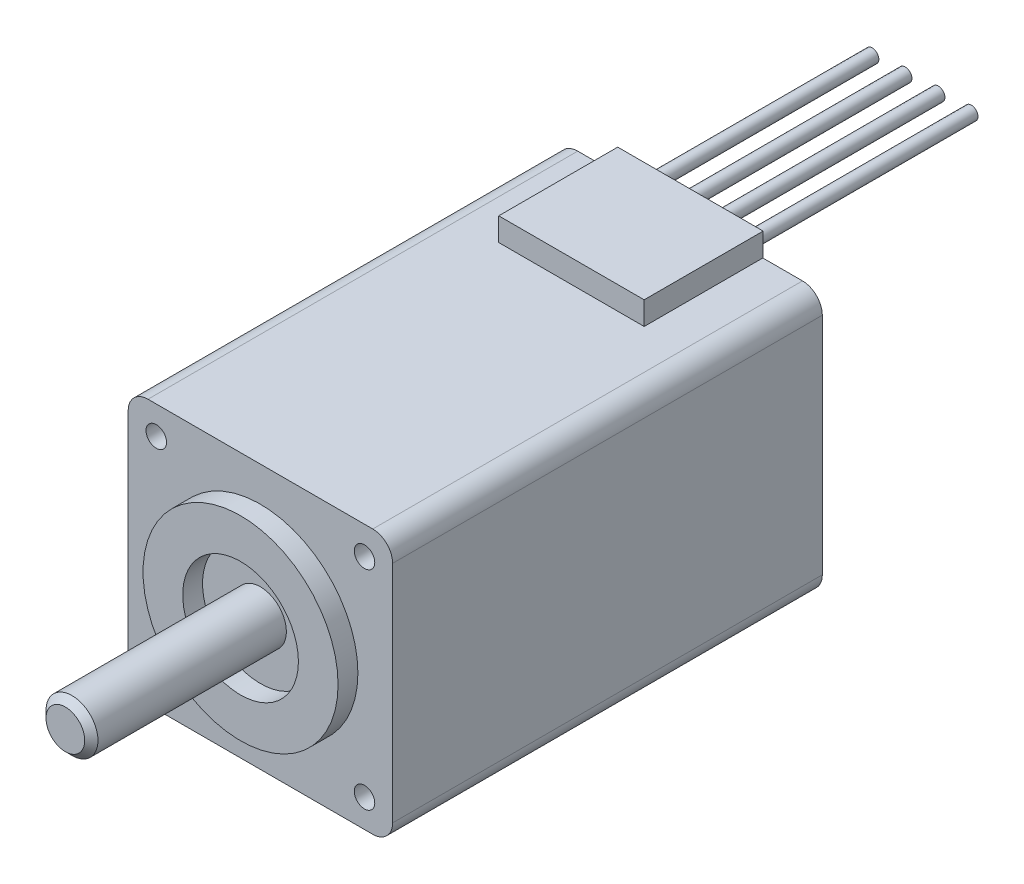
ISO-10303-21;
HEADER;
FILE_DESCRIPTION(('STEP AP214'),'2;1');
FILE_NAME('part.step','',(''),(''),'','','');
FILE_SCHEMA(('AUTOMOTIVE_DESIGN { 1 0 10303 214 1 1 1 1 }'));
ENDSEC;
DATA;
#1=APPLICATION_CONTEXT('core data for automotive mechanical design processes');
#2=APPLICATION_PROTOCOL_DEFINITION('international standard','automotive_design',2000,#1);
#3=PRODUCT_CONTEXT('',#1,'mechanical');
#4=PRODUCT('Part','Part','',(#3));
#5=PRODUCT_RELATED_PRODUCT_CATEGORY('part','',(#4));
#6=PRODUCT_DEFINITION_FORMATION('','',#4);
#7=PRODUCT_DEFINITION_CONTEXT('part definition',#1,'design');
#8=PRODUCT_DEFINITION('design','',#6,#7);
#9=PRODUCT_DEFINITION_SHAPE('','',#8);
#10=(LENGTH_UNIT() NAMED_UNIT(*) SI_UNIT(.MILLI.,.METRE.));
#11=(NAMED_UNIT(*) PLANE_ANGLE_UNIT() SI_UNIT($,.RADIAN.));
#12=(NAMED_UNIT(*) SI_UNIT($,.STERADIAN.) SOLID_ANGLE_UNIT());
#13=UNCERTAINTY_MEASURE_WITH_UNIT(LENGTH_MEASURE(1.E-05),#10,'distance_accuracy_value','');
#14=(GEOMETRIC_REPRESENTATION_CONTEXT(3) GLOBAL_UNCERTAINTY_ASSIGNED_CONTEXT((#13)) GLOBAL_UNIT_ASSIGNED_CONTEXT((#10,
#11,#12)) REPRESENTATION_CONTEXT('',''));
#15=CARTESIAN_POINT('',(0.,0.,0.));
#16=DIRECTION('',(0.,0.,1.));
#17=DIRECTION('',(1.,0.,0.));
#18=AXIS2_PLACEMENT_3D('',#15,#16,#17);
#19=CARTESIAN_POINT('',(10.16,10.16,33.02));
#20=DIRECTION('',(0.,0.,1.));
#21=DIRECTION('',(1.,0.,0.));
#22=AXIS2_PLACEMENT_3D('',#19,#20,#21);
#23=PLANE('',#22);
#24=CARTESIAN_POINT('',(8.001,-8.001,33.02));
#25=DIRECTION('',(0.,0.,1.));
#26=DIRECTION('',(1.,0.,0.));
#27=AXIS2_PLACEMENT_3D('',#24,#25,#26);
#28=CIRCLE('',#27,0.787400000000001);
#29=CARTESIAN_POINT('',(8.7884,-8.001,33.02));
#30=VERTEX_POINT('',#29);
#31=EDGE_CURVE('E197',#30,#30,#28,.T.);
#32=ORIENTED_EDGE('',*,*,#31,.F.);
#33=EDGE_LOOP('',(#32));
#34=FACE_BOUND('',#33,.T.);
#35=CARTESIAN_POINT('',(-8.001,8.001,33.02));
#36=DIRECTION('',(0.,0.,1.));
#37=DIRECTION('',(1.,0.,0.));
#38=AXIS2_PLACEMENT_3D('',#35,#36,#37);
#39=CIRCLE('',#38,0.787400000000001);
#40=CARTESIAN_POINT('',(-7.2136,8.001,33.02));
#41=VERTEX_POINT('',#40);
#42=EDGE_CURVE('E196',#41,#41,#39,.T.);
#43=ORIENTED_EDGE('',*,*,#42,.F.);
#44=EDGE_LOOP('',(#43));
#45=FACE_BOUND('',#44,.T.);
#46=CARTESIAN_POINT('',(-8.001,-8.001,33.02));
#47=DIRECTION('',(0.,0.,1.));
#48=DIRECTION('',(1.,0.,0.));
#49=AXIS2_PLACEMENT_3D('',#46,#47,#48);
#50=CIRCLE('',#49,0.787400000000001);
#51=CARTESIAN_POINT('',(-7.2136,-8.001,33.02));
#52=VERTEX_POINT('',#51);
#53=EDGE_CURVE('E212',#52,#52,#50,.T.);
#54=ORIENTED_EDGE('',*,*,#53,.F.);
#55=EDGE_LOOP('',(#54));
#56=FACE_BOUND('',#55,.T.);
#57=CARTESIAN_POINT('',(8.001,8.001,33.02));
#58=DIRECTION('',(0.,0.,1.));
#59=DIRECTION('',(1.,0.,0.));
#60=AXIS2_PLACEMENT_3D('',#57,#58,#59);
#61=CIRCLE('',#60,0.787400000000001);
#62=CARTESIAN_POINT('',(8.7884,8.001,33.02));
#63=VERTEX_POINT('',#62);
#64=EDGE_CURVE('E220',#63,#63,#61,.T.);
#65=ORIENTED_EDGE('',*,*,#64,.F.);
#66=EDGE_LOOP('',(#65));
#67=FACE_BOUND('',#66,.T.);
#68=DIRECTION('',(-1.,0.,0.));
#69=VECTOR('',#68,1.);
#70=CARTESIAN_POINT('',(10.16,10.16,33.02));
#71=LINE('',#70,#69);
#72=CARTESIAN_POINT('',(8.636,10.16,33.02));
#73=VERTEX_POINT('',#72);
#74=CARTESIAN_POINT('',(-8.636,10.16,33.02));
#75=VERTEX_POINT('',#74);
#76=EDGE_CURVE('E369',#73,#75,#71,.T.);
#77=ORIENTED_EDGE('',*,*,#76,.T.);
#78=CARTESIAN_POINT('',(-8.636,8.636,33.02));
#79=DIRECTION('',(0.,0.,1.));
#80=DIRECTION('',(1.,0.,0.));
#81=AXIS2_PLACEMENT_3D('',#78,#79,#80);
#82=CIRCLE('',#81,1.524);
#83=CARTESIAN_POINT('',(-10.16,8.636,33.02));
#84=VERTEX_POINT('',#83);
#85=EDGE_CURVE('E448',#75,#84,#82,.T.);
#86=ORIENTED_EDGE('',*,*,#85,.T.);
#87=DIRECTION('',(0.,-1.,0.));
#88=VECTOR('',#87,1.);
#89=CARTESIAN_POINT('',(-10.16,10.16,33.02));
#90=LINE('',#89,#88);
#91=CARTESIAN_POINT('',(-10.16,-8.636,33.02));
#92=VERTEX_POINT('',#91);
#93=EDGE_CURVE('E464',#84,#92,#90,.T.);
#94=ORIENTED_EDGE('',*,*,#93,.T.);
#95=CARTESIAN_POINT('',(-8.636,-8.636,33.02));
#96=DIRECTION('',(0.,0.,1.));
#97=DIRECTION('',(1.,0.,0.));
#98=AXIS2_PLACEMENT_3D('',#95,#96,#97);
#99=CIRCLE('',#98,1.524);
#100=CARTESIAN_POINT('',(-8.636,-10.16,33.02));
#101=VERTEX_POINT('',#100);
#102=EDGE_CURVE('E445',#92,#101,#99,.T.);
#103=ORIENTED_EDGE('',*,*,#102,.T.);
#104=DIRECTION('',(-1.,0.,0.));
#105=VECTOR('',#104,1.);
#106=CARTESIAN_POINT('',(10.16,-10.16,33.02));
#107=LINE('',#106,#105);
#108=CARTESIAN_POINT('',(8.636,-10.16,33.02));
#109=VERTEX_POINT('',#108);
#110=EDGE_CURVE('E370',#109,#101,#107,.T.);
#111=ORIENTED_EDGE('',*,*,#110,.F.);
#112=CARTESIAN_POINT('',(8.636,-8.636,33.02));
#113=DIRECTION('',(0.,0.,1.));
#114=DIRECTION('',(1.,0.,0.));
#115=AXIS2_PLACEMENT_3D('',#112,#113,#114);
#116=CIRCLE('',#115,1.524);
#117=CARTESIAN_POINT('',(10.16,-8.636,33.02));
#118=VERTEX_POINT('',#117);
#119=EDGE_CURVE('E59',#109,#118,#116,.T.);
#120=ORIENTED_EDGE('',*,*,#119,.T.);
#121=DIRECTION('',(0.,-1.,0.));
#122=VECTOR('',#121,1.);
#123=CARTESIAN_POINT('',(10.16,10.16,33.02));
#124=LINE('',#123,#122);
#125=CARTESIAN_POINT('',(10.16,8.636,33.02));
#126=VERTEX_POINT('',#125);
#127=EDGE_CURVE('E363',#126,#118,#124,.T.);
#128=ORIENTED_EDGE('',*,*,#127,.F.);
#129=CARTESIAN_POINT('',(8.636,8.636,33.02));
#130=DIRECTION('',(0.,0.,1.));
#131=DIRECTION('',(1.,0.,0.));
#132=AXIS2_PLACEMENT_3D('',#129,#130,#131);
#133=CIRCLE('',#132,1.524);
#134=EDGE_CURVE('E69',#126,#73,#133,.T.);
#135=ORIENTED_EDGE('',*,*,#134,.T.);
#136=EDGE_LOOP('',(#77,#86,#94,#103,#111,#120,#128,#135));
#137=FACE_BOUND('',#136,.T.);
#138=CARTESIAN_POINT('',(0.,0.,33.02));
#139=DIRECTION('',(0.,0.,1.));
#140=DIRECTION('',(1.,0.,0.));
#141=AXIS2_PLACEMENT_3D('',#138,#139,#140);
#142=CIRCLE('',#141,7.493);
#143=CARTESIAN_POINT('',(7.493,0.,33.02));
#144=VERTEX_POINT('',#143);
#145=EDGE_CURVE('E275',#144,#144,#142,.T.);
#146=ORIENTED_EDGE('',*,*,#145,.F.);
#147=EDGE_LOOP('',(#146));
#148=FACE_BOUND('',#147,.T.);
#149=ADVANCED_FACE('F40',(#34,#45,#56,#67,#137,#148),#23,.T.);
#150=CARTESIAN_POINT('',(0.,10.16,0.));
#151=DIRECTION('',(0.,-1.,0.));
#152=DIRECTION('',(0.,0.,-1.));
#153=AXIS2_PLACEMENT_3D('',#150,#151,#152);
#154=PLANE('',#153);
#155=DIRECTION('',(1.,0.,0.));
#156=VECTOR('',#155,1.);
#157=CARTESIAN_POINT('',(-10.16,10.16,0.));
#158=LINE('',#157,#156);
#159=CARTESIAN_POINT('',(-8.636,10.16,0.));
#160=VERTEX_POINT('',#159);
#161=CARTESIAN_POINT('',(-5.588,10.16,0.));
#162=VERTEX_POINT('',#161);
#163=EDGE_CURVE('E359',#160,#162,#158,.T.);
#164=ORIENTED_EDGE('',*,*,#163,.F.);
#165=DIRECTION('',(0.,0.,-1.));
#166=VECTOR('',#165,1.);
#167=CARTESIAN_POINT('',(-8.636,10.16,33.02));
#168=LINE('',#167,#166);
#169=EDGE_CURVE('E439',#160,#75,#168,.F.);
#170=ORIENTED_EDGE('',*,*,#169,.T.);
#171=ORIENTED_EDGE('',*,*,#76,.F.);
#172=DIRECTION('',(0.,0.,1.));
#173=VECTOR('',#172,1.);
#174=CARTESIAN_POINT('',(8.636,10.16,0.));
#175=LINE('',#174,#173);
#176=CARTESIAN_POINT('',(8.636,10.16,0.));
#177=VERTEX_POINT('',#176);
#178=EDGE_CURVE('E433',#73,#177,#175,.F.);
#179=ORIENTED_EDGE('',*,*,#178,.T.);
#180=CARTESIAN_POINT('',(5.588,10.16,0.));
#181=VERTEX_POINT('',#180);
#182=EDGE_CURVE('E364',#181,#177,#158,.T.);
#183=ORIENTED_EDGE('',*,*,#182,.F.);
#184=DIRECTION('',(0.,0.,-1.));
#185=VECTOR('',#184,1.);
#186=CARTESIAN_POINT('',(5.588,10.16,-0.0254));
#187=LINE('',#186,#185);
#188=CARTESIAN_POINT('',(5.588,10.16,9.1186));
#189=VERTEX_POINT('',#188);
#190=EDGE_CURVE('E280',#189,#181,#187,.T.);
#191=ORIENTED_EDGE('',*,*,#190,.F.);
#192=DIRECTION('',(1.,0.,0.));
#193=VECTOR('',#192,1.);
#194=CARTESIAN_POINT('',(5.588,10.16,9.1186));
#195=LINE('',#194,#193);
#196=CARTESIAN_POINT('',(-5.588,10.16,9.1186));
#197=VERTEX_POINT('',#196);
#198=EDGE_CURVE('E289',#197,#189,#195,.T.);
#199=ORIENTED_EDGE('',*,*,#198,.F.);
#200=DIRECTION('',(0.,0.,1.));
#201=VECTOR('',#200,1.);
#202=CARTESIAN_POINT('',(-5.588,10.16,9.1186));
#203=LINE('',#202,#201);
#204=EDGE_CURVE('E338',#162,#197,#203,.T.);
#205=ORIENTED_EDGE('',*,*,#204,.F.);
#206=EDGE_LOOP('',(#164,#170,#171,#179,#183,#191,#199,#205));
#207=FACE_BOUND('',#206,.T.);
#208=ADVANCED_FACE('F397',(#207),#154,.F.);
#209=CARTESIAN_POINT('',(10.16,10.16,0.));
#210=DIRECTION('',(1.,0.,0.));
#211=DIRECTION('',(0.,0.,-1.));
#212=AXIS2_PLACEMENT_3D('',#209,#210,#211);
#213=PLANE('',#212);
#214=ORIENTED_EDGE('',*,*,#127,.T.);
#215=DIRECTION('',(0.,0.,1.));
#216=VECTOR('',#215,1.);
#217=CARTESIAN_POINT('',(10.16,-8.636,0.));
#218=LINE('',#217,#216);
#219=CARTESIAN_POINT('',(10.16,-8.636,0.));
#220=VERTEX_POINT('',#219);
#221=EDGE_CURVE('E11',#118,#220,#218,.F.);
#222=ORIENTED_EDGE('',*,*,#221,.T.);
#223=DIRECTION('',(0.,-1.,0.));
#224=VECTOR('',#223,1.);
#225=CARTESIAN_POINT('',(10.16,10.16,0.));
#226=LINE('',#225,#224);
#227=CARTESIAN_POINT('',(10.16,8.636,0.));
#228=VERTEX_POINT('',#227);
#229=EDGE_CURVE('E343',#228,#220,#226,.T.);
#230=ORIENTED_EDGE('',*,*,#229,.F.);
#231=DIRECTION('',(0.,0.,1.));
#232=VECTOR('',#231,1.);
#233=CARTESIAN_POINT('',(10.16,8.636,33.02));
#234=LINE('',#233,#232);
#235=EDGE_CURVE('E49',#228,#126,#234,.T.);
#236=ORIENTED_EDGE('',*,*,#235,.T.);
#237=EDGE_LOOP('',(#214,#222,#230,#236));
#238=FACE_BOUND('',#237,.T.);
#239=ADVANCED_FACE('F456',(#238),#213,.T.);
#240=CARTESIAN_POINT('',(-10.16,10.16,0.));
#241=DIRECTION('',(0.,0.,-1.));
#242=DIRECTION('',(-1.,0.,0.));
#243=AXIS2_PLACEMENT_3D('',#240,#241,#242);
#244=PLANE('',#243);
#245=CARTESIAN_POINT('',(0.,0.,0.));
#246=DIRECTION('',(0.,0.,-1.));
#247=DIRECTION('',(-1.,0.,0.));
#248=AXIS2_PLACEMENT_3D('',#245,#246,#247);
#249=CIRCLE('',#248,4.44499999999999);
#250=CARTESIAN_POINT('',(-4.44499999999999,0.,0.));
#251=VERTEX_POINT('',#250);
#252=EDGE_CURVE('E228',#251,#251,#249,.T.);
#253=ORIENTED_EDGE('',*,*,#252,.F.);
#254=EDGE_LOOP('',(#253));
#255=FACE_BOUND('',#254,.T.);
#256=DIRECTION('',(0.,-1.,0.));
#257=VECTOR('',#256,1.);
#258=CARTESIAN_POINT('',(-10.16,10.16,0.));
#259=LINE('',#258,#257);
#260=CARTESIAN_POINT('',(-10.16,8.636,0.));
#261=VERTEX_POINT('',#260);
#262=CARTESIAN_POINT('',(-10.16,-8.636,0.));
#263=VERTEX_POINT('',#262);
#264=EDGE_CURVE('E419',#261,#263,#259,.T.);
#265=ORIENTED_EDGE('',*,*,#264,.F.);
#266=CARTESIAN_POINT('',(-8.636,8.636,0.));
#267=DIRECTION('',(0.,0.,-1.));
#268=DIRECTION('',(-1.,0.,0.));
#269=AXIS2_PLACEMENT_3D('',#266,#267,#268);
#270=CIRCLE('',#269,1.524);
#271=EDGE_CURVE('E427',#261,#160,#270,.T.);
#272=ORIENTED_EDGE('',*,*,#271,.T.);
#273=ORIENTED_EDGE('',*,*,#163,.T.);
#274=DIRECTION('',(0.,1.,0.));
#275=VECTOR('',#274,1.);
#276=CARTESIAN_POINT('',(-5.588,10.16,0.));
#277=LINE('',#276,#275);
#278=CARTESIAN_POINT('',(-5.588,8.128,0.));
#279=VERTEX_POINT('',#278);
#280=EDGE_CURVE('E316',#279,#162,#277,.T.);
#281=ORIENTED_EDGE('',*,*,#280,.F.);
#282=DIRECTION('',(-1.,0.,0.));
#283=VECTOR('',#282,1.);
#284=CARTESIAN_POINT('',(-5.588,8.128,0.));
#285=LINE('',#284,#283);
#286=CARTESIAN_POINT('',(5.588,8.128,0.));
#287=VERTEX_POINT('',#286);
#288=EDGE_CURVE('E323',#287,#279,#285,.T.);
#289=ORIENTED_EDGE('',*,*,#288,.F.);
#290=DIRECTION('',(0.,-1.,0.));
#291=VECTOR('',#290,1.);
#292=CARTESIAN_POINT('',(5.588,8.128,0.));
#293=LINE('',#292,#291);
#294=EDGE_CURVE('E327',#181,#287,#293,.T.);
#295=ORIENTED_EDGE('',*,*,#294,.F.);
#296=ORIENTED_EDGE('',*,*,#182,.T.);
#297=CARTESIAN_POINT('',(8.636,8.636,0.));
#298=DIRECTION('',(0.,0.,-1.));
#299=DIRECTION('',(-1.,0.,0.));
#300=AXIS2_PLACEMENT_3D('',#297,#298,#299);
#301=CIRCLE('',#300,1.524);
#302=EDGE_CURVE('E358',#177,#228,#301,.T.);
#303=ORIENTED_EDGE('',*,*,#302,.T.);
#304=ORIENTED_EDGE('',*,*,#229,.T.);
#305=CARTESIAN_POINT('',(8.636,-8.636,0.));
#306=DIRECTION('',(0.,0.,-1.));
#307=DIRECTION('',(-1.,0.,0.));
#308=AXIS2_PLACEMENT_3D('',#305,#306,#307);
#309=CIRCLE('',#308,1.524);
#310=CARTESIAN_POINT('',(8.636,-10.16,0.));
#311=VERTEX_POINT('',#310);
#312=EDGE_CURVE('E428',#220,#311,#309,.T.);
#313=ORIENTED_EDGE('',*,*,#312,.T.);
#314=DIRECTION('',(1.,0.,0.));
#315=VECTOR('',#314,1.);
#316=CARTESIAN_POINT('',(-10.16,-10.16,0.));
#317=LINE('',#316,#315);
#318=CARTESIAN_POINT('',(-8.636,-10.16,0.));
#319=VERTEX_POINT('',#318);
#320=EDGE_CURVE('E416',#319,#311,#317,.T.);
#321=ORIENTED_EDGE('',*,*,#320,.F.);
#322=CARTESIAN_POINT('',(-8.636,-8.636,0.));
#323=DIRECTION('',(0.,0.,-1.));
#324=DIRECTION('',(-1.,0.,0.));
#325=AXIS2_PLACEMENT_3D('',#322,#323,#324);
#326=CIRCLE('',#325,1.524);
#327=EDGE_CURVE('E426',#319,#263,#326,.T.);
#328=ORIENTED_EDGE('',*,*,#327,.T.);
#329=EDGE_LOOP('',(#265,#272,#273,#281,#289,#295,#296,#303,#304,#313,#321,#328));
#330=FACE_BOUND('',#329,.T.);
#331=ADVANCED_FACE('F407',(#255,#330),#244,.T.);
#332=CARTESIAN_POINT('',(-10.16,10.16,33.02));
#333=DIRECTION('',(-1.,0.,0.));
#334=DIRECTION('',(0.,0.,1.));
#335=AXIS2_PLACEMENT_3D('',#332,#333,#334);
#336=PLANE('',#335);
#337=ORIENTED_EDGE('',*,*,#93,.F.);
#338=DIRECTION('',(0.,0.,-1.));
#339=VECTOR('',#338,1.);
#340=CARTESIAN_POINT('',(-10.16,8.636,0.));
#341=LINE('',#340,#339);
#342=EDGE_CURVE('E354',#84,#261,#341,.T.);
#343=ORIENTED_EDGE('',*,*,#342,.T.);
#344=ORIENTED_EDGE('',*,*,#264,.T.);
#345=DIRECTION('',(0.,0.,-1.));
#346=VECTOR('',#345,1.);
#347=CARTESIAN_POINT('',(-10.16,-8.636,33.02));
#348=LINE('',#347,#346);
#349=EDGE_CURVE('E351',#263,#92,#348,.F.);
#350=ORIENTED_EDGE('',*,*,#349,.T.);
#351=EDGE_LOOP('',(#337,#343,#344,#350));
#352=FACE_BOUND('',#351,.T.);
#353=ADVANCED_FACE('F481',(#352),#336,.T.);
#354=CARTESIAN_POINT('',(0.,-10.16,0.));
#355=DIRECTION('',(0.,-1.,0.));
#356=DIRECTION('',(0.,0.,-1.));
#357=AXIS2_PLACEMENT_3D('',#354,#355,#356);
#358=PLANE('',#357);
#359=ORIENTED_EDGE('',*,*,#110,.T.);
#360=DIRECTION('',(0.,0.,-1.));
#361=VECTOR('',#360,1.);
#362=CARTESIAN_POINT('',(-8.636,-10.16,0.));
#363=LINE('',#362,#361);
#364=EDGE_CURVE('E421',#101,#319,#363,.T.);
#365=ORIENTED_EDGE('',*,*,#364,.T.);
#366=ORIENTED_EDGE('',*,*,#320,.T.);
#367=DIRECTION('',(0.,0.,1.));
#368=VECTOR('',#367,1.);
#369=CARTESIAN_POINT('',(8.636,-10.16,0.));
#370=LINE('',#369,#368);
#371=EDGE_CURVE('E423',#311,#109,#370,.T.);
#372=ORIENTED_EDGE('',*,*,#371,.T.);
#373=EDGE_LOOP('',(#359,#365,#366,#372));
#374=FACE_BOUND('',#373,.T.);
#375=ADVANCED_FACE('F486',(#374),#358,.T.);
#376=CARTESIAN_POINT('',(5.588,8.128,-0.0254));
#377=DIRECTION('',(-1.,0.,0.));
#378=DIRECTION('',(0.,0.,1.));
#379=AXIS2_PLACEMENT_3D('',#376,#377,#378);
#380=PLANE('',#379);
#381=ORIENTED_EDGE('',*,*,#294,.T.);
#382=DIRECTION('',(0.,0.,1.));
#383=VECTOR('',#382,1.);
#384=CARTESIAN_POINT('',(5.588,8.128,-0.0254));
#385=LINE('',#384,#383);
#386=CARTESIAN_POINT('',(5.588,8.128,-0.0254));
#387=VERTEX_POINT('',#386);
#388=EDGE_CURVE('E411',#387,#287,#385,.T.);
#389=ORIENTED_EDGE('',*,*,#388,.F.);
#390=DIRECTION('',(0.,-1.,0.));
#391=VECTOR('',#390,1.);
#392=CARTESIAN_POINT('',(5.588,8.128,-0.0254));
#393=LINE('',#392,#391);
#394=CARTESIAN_POINT('',(5.588,11.938,-0.0254));
#395=VERTEX_POINT('',#394);
#396=EDGE_CURVE('E311',#395,#387,#393,.T.);
#397=ORIENTED_EDGE('',*,*,#396,.F.);
#398=DIRECTION('',(0.,0.,-1.));
#399=VECTOR('',#398,1.);
#400=CARTESIAN_POINT('',(5.588,11.938,-0.0254));
#401=LINE('',#400,#399);
#402=CARTESIAN_POINT('',(5.588,11.938,9.1186));
#403=VERTEX_POINT('',#402);
#404=EDGE_CURVE('E284',#403,#395,#401,.T.);
#405=ORIENTED_EDGE('',*,*,#404,.F.);
#406=DIRECTION('',(0.,-1.,0.));
#407=VECTOR('',#406,1.);
#408=CARTESIAN_POINT('',(5.588,11.938,9.1186));
#409=LINE('',#408,#407);
#410=EDGE_CURVE('E299',#403,#189,#409,.T.);
#411=ORIENTED_EDGE('',*,*,#410,.T.);
#412=ORIENTED_EDGE('',*,*,#190,.T.);
#413=EDGE_LOOP('',(#381,#389,#397,#405,#411,#412));
#414=FACE_BOUND('',#413,.T.);
#415=ADVANCED_FACE('F491',(#414),#380,.F.);
#416=CARTESIAN_POINT('',(-5.588,8.128,-0.0254));
#417=DIRECTION('',(0.,1.,0.));
#418=DIRECTION('',(0.,0.,1.));
#419=AXIS2_PLACEMENT_3D('',#416,#417,#418);
#420=PLANE('',#419);
#421=ORIENTED_EDGE('',*,*,#288,.T.);
#422=DIRECTION('',(0.,0.,1.));
#423=VECTOR('',#422,1.);
#424=CARTESIAN_POINT('',(-5.588,8.128,-0.0254));
#425=LINE('',#424,#423);
#426=CARTESIAN_POINT('',(-5.588,8.128,-0.0254));
#427=VERTEX_POINT('',#426);
#428=EDGE_CURVE('E322',#427,#279,#425,.T.);
#429=ORIENTED_EDGE('',*,*,#428,.F.);
#430=DIRECTION('',(-1.,0.,0.));
#431=VECTOR('',#430,1.);
#432=CARTESIAN_POINT('',(-5.588,8.128,-0.0254));
#433=LINE('',#432,#431);
#434=EDGE_CURVE('E315',#387,#427,#433,.T.);
#435=ORIENTED_EDGE('',*,*,#434,.F.);
#436=ORIENTED_EDGE('',*,*,#388,.T.);
#437=EDGE_LOOP('',(#421,#429,#435,#436));
#438=FACE_BOUND('',#437,.T.);
#439=ADVANCED_FACE('F410',(#438),#420,.F.);
#440=CARTESIAN_POINT('',(-5.588,10.16,-0.0254));
#441=DIRECTION('',(1.,0.,0.));
#442=DIRECTION('',(0.,0.,-1.));
#443=AXIS2_PLACEMENT_3D('',#440,#441,#442);
#444=PLANE('',#443);
#445=ORIENTED_EDGE('',*,*,#280,.T.);
#446=ORIENTED_EDGE('',*,*,#204,.T.);
#447=DIRECTION('',(0.,-1.,0.));
#448=VECTOR('',#447,1.);
#449=CARTESIAN_POINT('',(-5.588,11.938,9.1186));
#450=LINE('',#449,#448);
#451=CARTESIAN_POINT('',(-5.588,11.938,9.1186));
#452=VERTEX_POINT('',#451);
#453=EDGE_CURVE('E309',#452,#197,#450,.T.);
#454=ORIENTED_EDGE('',*,*,#453,.F.);
#455=DIRECTION('',(0.,0.,1.));
#456=VECTOR('',#455,1.);
#457=CARTESIAN_POINT('',(-5.588,11.938,9.1186));
#458=LINE('',#457,#456);
#459=CARTESIAN_POINT('',(-5.588,11.938,-0.0254));
#460=VERTEX_POINT('',#459);
#461=EDGE_CURVE('E293',#460,#452,#458,.T.);
#462=ORIENTED_EDGE('',*,*,#461,.F.);
#463=DIRECTION('',(0.,1.,0.));
#464=VECTOR('',#463,1.);
#465=CARTESIAN_POINT('',(-5.588,10.16,-0.0254));
#466=LINE('',#465,#464);
#467=EDGE_CURVE('E319',#427,#460,#466,.T.);
#468=ORIENTED_EDGE('',*,*,#467,.F.);
#469=ORIENTED_EDGE('',*,*,#428,.T.);
#470=EDGE_LOOP('',(#445,#446,#454,#462,#468,#469));
#471=FACE_BOUND('',#470,.T.);
#472=ADVANCED_FACE('F400',(#471),#444,.F.);
#473=CARTESIAN_POINT('',(0.,0.,-0.0254));
#474=DIRECTION('',(0.,0.,1.));
#475=DIRECTION('',(1.,0.,0.));
#476=AXIS2_PLACEMENT_3D('',#473,#474,#475);
#477=PLANE('',#476);
#478=CARTESIAN_POINT('',(-1.27,10.033,-0.0254));
#479=DIRECTION('',(0.,0.,-1.));
#480=DIRECTION('',(-1.,0.,0.));
#481=AXIS2_PLACEMENT_3D('',#478,#479,#480);
#482=CIRCLE('',#481,0.508);
#483=CARTESIAN_POINT('',(-1.778,10.033,-0.0254));
#484=VERTEX_POINT('',#483);
#485=EDGE_CURVE('E242',#484,#484,#482,.T.);
#486=ORIENTED_EDGE('',*,*,#485,.F.);
#487=EDGE_LOOP('',(#486));
#488=FACE_BOUND('',#487,.T.);
#489=CARTESIAN_POINT('',(3.81,10.033,-0.0254));
#490=DIRECTION('',(0.,0.,-1.));
#491=DIRECTION('',(-1.,0.,0.));
#492=AXIS2_PLACEMENT_3D('',#489,#490,#491);
#493=CIRCLE('',#492,0.508);
#494=CARTESIAN_POINT('',(3.302,10.033,-0.0254));
#495=VERTEX_POINT('',#494);
#496=EDGE_CURVE('E249',#495,#495,#493,.T.);
#497=ORIENTED_EDGE('',*,*,#496,.F.);
#498=EDGE_LOOP('',(#497));
#499=FACE_BOUND('',#498,.T.);
#500=CARTESIAN_POINT('',(1.27,10.033,-0.0254));
#501=DIRECTION('',(0.,0.,-1.));
#502=DIRECTION('',(-1.,0.,0.));
#503=AXIS2_PLACEMENT_3D('',#500,#501,#502);
#504=CIRCLE('',#503,0.508);
#505=CARTESIAN_POINT('',(0.762,10.033,-0.0254));
#506=VERTEX_POINT('',#505);
#507=EDGE_CURVE('E256',#506,#506,#504,.T.);
#508=ORIENTED_EDGE('',*,*,#507,.F.);
#509=EDGE_LOOP('',(#508));
#510=FACE_BOUND('',#509,.T.);
#511=CARTESIAN_POINT('',(-3.81,10.033,-0.0254));
#512=DIRECTION('',(0.,0.,-1.));
#513=DIRECTION('',(-1.,0.,0.));
#514=AXIS2_PLACEMENT_3D('',#511,#512,#513);
#515=CIRCLE('',#514,0.508);
#516=CARTESIAN_POINT('',(-4.318,10.033,-0.0254));
#517=VERTEX_POINT('',#516);
#518=EDGE_CURVE('E263',#517,#517,#515,.T.);
#519=ORIENTED_EDGE('',*,*,#518,.F.);
#520=EDGE_LOOP('',(#519));
#521=FACE_BOUND('',#520,.T.);
#522=ORIENTED_EDGE('',*,*,#396,.T.);
#523=ORIENTED_EDGE('',*,*,#434,.T.);
#524=ORIENTED_EDGE('',*,*,#467,.T.);
#525=DIRECTION('',(-1.,0.,0.));
#526=VECTOR('',#525,1.);
#527=CARTESIAN_POINT('',(-5.588,11.938,-0.0254));
#528=LINE('',#527,#526);
#529=EDGE_CURVE('E288',#395,#460,#528,.T.);
#530=ORIENTED_EDGE('',*,*,#529,.F.);
#531=EDGE_LOOP('',(#522,#523,#524,#530));
#532=FACE_BOUND('',#531,.T.);
#533=ADVANCED_FACE('F749',(#488,#499,#510,#521,#532),#477,.F.);
#534=CARTESIAN_POINT('',(5.588,11.938,9.1186));
#535=DIRECTION('',(0.,0.,-1.));
#536=DIRECTION('',(-1.,0.,0.));
#537=AXIS2_PLACEMENT_3D('',#534,#535,#536);
#538=PLANE('',#537);
#539=ORIENTED_EDGE('',*,*,#198,.T.);
#540=ORIENTED_EDGE('',*,*,#410,.F.);
#541=DIRECTION('',(1.,0.,0.));
#542=VECTOR('',#541,1.);
#543=CARTESIAN_POINT('',(5.588,11.938,9.1186));
#544=LINE('',#543,#542);
#545=EDGE_CURVE('E296',#452,#403,#544,.T.);
#546=ORIENTED_EDGE('',*,*,#545,.F.);
#547=ORIENTED_EDGE('',*,*,#453,.T.);
#548=EDGE_LOOP('',(#539,#540,#546,#547));
#549=FACE_BOUND('',#548,.T.);
#550=ADVANCED_FACE('F393',(#549),#538,.F.);
#551=CARTESIAN_POINT('',(0.,11.938,0.));
#552=DIRECTION('',(0.,-1.,0.));
#553=DIRECTION('',(0.,0.,-1.));
#554=AXIS2_PLACEMENT_3D('',#551,#552,#553);
#555=PLANE('',#554);
#556=ORIENTED_EDGE('',*,*,#404,.T.);
#557=ORIENTED_EDGE('',*,*,#529,.T.);
#558=ORIENTED_EDGE('',*,*,#461,.T.);
#559=ORIENTED_EDGE('',*,*,#545,.T.);
#560=EDGE_LOOP('',(#556,#557,#558,#559));
#561=FACE_BOUND('',#560,.T.);
#562=ADVANCED_FACE('F839',(#561),#555,.F.);
#563=CARTESIAN_POINT('',(0.,0.,34.544));
#564=DIRECTION('',(0.,0.,-1.));
#565=DIRECTION('',(-1.,0.,0.));
#566=AXIS2_PLACEMENT_3D('',#563,#564,#565);
#567=CYLINDRICAL_SURFACE('',#566,7.493);
#568=CARTESIAN_POINT('',(0.,0.,34.544));
#569=DIRECTION('',(0.,0.,1.));
#570=DIRECTION('',(1.,0.,0.));
#571=AXIS2_PLACEMENT_3D('',#568,#569,#570);
#572=CIRCLE('',#571,7.493);
#573=CARTESIAN_POINT('',(7.493,0.,34.544));
#574=VERTEX_POINT('',#573);
#575=EDGE_CURVE('E276',#574,#574,#572,.T.);
#576=ORIENTED_EDGE('',*,*,#575,.F.);
#577=EDGE_LOOP('',(#576));
#578=FACE_BOUND('',#577,.T.);
#579=ORIENTED_EDGE('',*,*,#145,.T.);
#580=EDGE_LOOP('',(#579));
#581=FACE_BOUND('',#580,.T.);
#582=ADVANCED_FACE('F830',(#578,#581),#567,.T.);
#583=CARTESIAN_POINT('',(0.,0.,34.544));
#584=DIRECTION('',(0.,0.,1.));
#585=DIRECTION('',(1.,0.,0.));
#586=AXIS2_PLACEMENT_3D('',#583,#584,#585);
#587=PLANE('',#586);
#588=CARTESIAN_POINT('',(0.,0.,34.544));
#589=DIRECTION('',(0.,0.,1.));
#590=DIRECTION('',(1.,0.,0.));
#591=AXIS2_PLACEMENT_3D('',#588,#589,#590);
#592=CIRCLE('',#591,4.44499999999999);
#593=CARTESIAN_POINT('',(4.44499999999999,0.,34.544));
#594=VERTEX_POINT('',#593);
#595=EDGE_CURVE('E267',#594,#594,#592,.T.);
#596=ORIENTED_EDGE('',*,*,#595,.F.);
#597=EDGE_LOOP('',(#596));
#598=FACE_BOUND('',#597,.T.);
#599=ORIENTED_EDGE('',*,*,#575,.T.);
#600=EDGE_LOOP('',(#599));
#601=FACE_BOUND('',#600,.T.);
#602=ADVANCED_FACE('F719',(#598,#601),#587,.T.);
#603=CARTESIAN_POINT('',(0.,0.,33.02));
#604=DIRECTION('',(0.,0.,-1.));
#605=DIRECTION('',(-1.,0.,0.));
#606=AXIS2_PLACEMENT_3D('',#603,#604,#605);
#607=PLANE('',#606);
#608=CARTESIAN_POINT('',(0.,0.,33.02));
#609=DIRECTION('',(0.,0.,1.));
#610=DIRECTION('',(1.,0.,0.));
#611=AXIS2_PLACEMENT_3D('',#608,#609,#610);
#612=CIRCLE('',#611,1.99644);
#613=CARTESIAN_POINT('',(1.99644,0.,33.02));
#614=VERTEX_POINT('',#613);
#615=EDGE_CURVE('E236',#614,#614,#612,.T.);
#616=ORIENTED_EDGE('',*,*,#615,.F.);
#617=EDGE_LOOP('',(#616));
#618=FACE_BOUND('',#617,.T.);
#619=CARTESIAN_POINT('',(0.,0.,33.02));
#620=DIRECTION('',(0.,0.,1.));
#621=DIRECTION('',(1.,0.,0.));
#622=AXIS2_PLACEMENT_3D('',#619,#620,#621);
#623=CIRCLE('',#622,4.44499999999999);
#624=CARTESIAN_POINT('',(4.44499999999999,0.,33.02));
#625=VERTEX_POINT('',#624);
#626=EDGE_CURVE('E271',#625,#625,#623,.T.);
#627=ORIENTED_EDGE('',*,*,#626,.T.);
#628=EDGE_LOOP('',(#627));
#629=FACE_BOUND('',#628,.T.);
#630=ADVANCED_FACE('F713',(#618,#629),#607,.F.);
#631=CARTESIAN_POINT('',(0.,0.,34.544));
#632=DIRECTION('',(0.,0.,1.));
#633=DIRECTION('',(1.,0.,0.));
#634=AXIS2_PLACEMENT_3D('',#631,#632,#633);
#635=CYLINDRICAL_SURFACE('',#634,4.44499999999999);
#636=ORIENTED_EDGE('',*,*,#626,.F.);
#637=EDGE_LOOP('',(#636));
#638=FACE_BOUND('',#637,.T.);
#639=ORIENTED_EDGE('',*,*,#595,.T.);
#640=EDGE_LOOP('',(#639));
#641=FACE_BOUND('',#640,.T.);
#642=ADVANCED_FACE('F718',(#638,#641),#635,.F.);
#643=CARTESIAN_POINT('',(-3.81,10.033,-0.0254));
#644=DIRECTION('',(0.,0.,-1.));
#645=DIRECTION('',(-1.,0.,0.));
#646=AXIS2_PLACEMENT_3D('',#643,#644,#645);
#647=CYLINDRICAL_SURFACE('',#646,0.508);
#648=ORIENTED_EDGE('',*,*,#518,.T.);
#649=EDGE_LOOP('',(#648));
#650=FACE_BOUND('',#649,.T.);
#651=CARTESIAN_POINT('',(-3.81,10.033,-17.8054));
#652=DIRECTION('',(0.,0.,-1.));
#653=DIRECTION('',(-1.,0.,0.));
#654=AXIS2_PLACEMENT_3D('',#651,#652,#653);
#655=CIRCLE('',#654,0.508);
#656=CARTESIAN_POINT('',(-4.318,10.033,-17.8054));
#657=VERTEX_POINT('',#656);
#658=EDGE_CURVE('E260',#657,#657,#655,.T.);
#659=ORIENTED_EDGE('',*,*,#658,.F.);
#660=EDGE_LOOP('',(#659));
#661=FACE_BOUND('',#660,.T.);
#662=ADVANCED_FACE('F806',(#650,#661),#647,.T.);
#663=CARTESIAN_POINT('',(-3.81,10.033,-17.8054));
#664=DIRECTION('',(0.,0.,-1.));
#665=DIRECTION('',(-1.,0.,0.));
#666=AXIS2_PLACEMENT_3D('',#663,#664,#665);
#667=PLANE('',#666);
#668=ORIENTED_EDGE('',*,*,#658,.T.);
#669=EDGE_LOOP('',(#668));
#670=FACE_BOUND('',#669,.T.);
#671=ADVANCED_FACE('F796',(#670),#667,.T.);
#672=CARTESIAN_POINT('',(1.27,10.033,-0.0254));
#673=DIRECTION('',(0.,0.,-1.));
#674=DIRECTION('',(-1.,0.,0.));
#675=AXIS2_PLACEMENT_3D('',#672,#673,#674);
#676=CYLINDRICAL_SURFACE('',#675,0.508);
#677=ORIENTED_EDGE('',*,*,#507,.T.);
#678=EDGE_LOOP('',(#677));
#679=FACE_BOUND('',#678,.T.);
#680=CARTESIAN_POINT('',(1.27,10.033,-17.8054));
#681=DIRECTION('',(0.,0.,-1.));
#682=DIRECTION('',(-1.,0.,0.));
#683=AXIS2_PLACEMENT_3D('',#680,#681,#682);
#684=CIRCLE('',#683,0.508);
#685=CARTESIAN_POINT('',(0.762,10.033,-17.8054));
#686=VERTEX_POINT('',#685);
#687=EDGE_CURVE('E253',#686,#686,#684,.T.);
#688=ORIENTED_EDGE('',*,*,#687,.F.);
#689=EDGE_LOOP('',(#688));
#690=FACE_BOUND('',#689,.T.);
#691=ADVANCED_FACE('F786',(#679,#690),#676,.T.);
#692=CARTESIAN_POINT('',(1.27,10.033,-17.8054));
#693=DIRECTION('',(0.,0.,-1.));
#694=DIRECTION('',(-1.,0.,0.));
#695=AXIS2_PLACEMENT_3D('',#692,#693,#694);
#696=PLANE('',#695);
#697=ORIENTED_EDGE('',*,*,#687,.T.);
#698=EDGE_LOOP('',(#697));
#699=FACE_BOUND('',#698,.T.);
#700=ADVANCED_FACE('F776',(#699),#696,.T.);
#701=CARTESIAN_POINT('',(3.81,10.033,-0.0254));
#702=DIRECTION('',(0.,0.,-1.));
#703=DIRECTION('',(-1.,0.,0.));
#704=AXIS2_PLACEMENT_3D('',#701,#702,#703);
#705=CYLINDRICAL_SURFACE('',#704,0.508);
#706=ORIENTED_EDGE('',*,*,#496,.T.);
#707=EDGE_LOOP('',(#706));
#708=FACE_BOUND('',#707,.T.);
#709=CARTESIAN_POINT('',(3.81,10.033,-17.8054));
#710=DIRECTION('',(0.,0.,-1.));
#711=DIRECTION('',(-1.,0.,0.));
#712=AXIS2_PLACEMENT_3D('',#709,#710,#711);
#713=CIRCLE('',#712,0.508);
#714=CARTESIAN_POINT('',(3.302,10.033,-17.8054));
#715=VERTEX_POINT('',#714);
#716=EDGE_CURVE('E246',#715,#715,#713,.T.);
#717=ORIENTED_EDGE('',*,*,#716,.F.);
#718=EDGE_LOOP('',(#717));
#719=FACE_BOUND('',#718,.T.);
#720=ADVANCED_FACE('F766',(#708,#719),#705,.T.);
#721=CARTESIAN_POINT('',(3.81,10.033,-17.8054));
#722=DIRECTION('',(0.,0.,-1.));
#723=DIRECTION('',(-1.,0.,0.));
#724=AXIS2_PLACEMENT_3D('',#721,#722,#723);
#725=PLANE('',#724);
#726=ORIENTED_EDGE('',*,*,#716,.T.);
#727=EDGE_LOOP('',(#726));
#728=FACE_BOUND('',#727,.T.);
#729=ADVANCED_FACE('F741',(#728),#725,.T.);
#730=CARTESIAN_POINT('',(-1.27,10.033,-0.0254));
#731=DIRECTION('',(0.,0.,-1.));
#732=DIRECTION('',(-1.,0.,0.));
#733=AXIS2_PLACEMENT_3D('',#730,#731,#732);
#734=CYLINDRICAL_SURFACE('',#733,0.508);
#735=ORIENTED_EDGE('',*,*,#485,.T.);
#736=EDGE_LOOP('',(#735));
#737=FACE_BOUND('',#736,.T.);
#738=CARTESIAN_POINT('',(-1.27,10.033,-17.8054));
#739=DIRECTION('',(0.,0.,-1.));
#740=DIRECTION('',(-1.,0.,0.));
#741=AXIS2_PLACEMENT_3D('',#738,#739,#740);
#742=CIRCLE('',#741,0.508);
#743=CARTESIAN_POINT('',(-1.778,10.033,-17.8054));
#744=VERTEX_POINT('',#743);
#745=EDGE_CURVE('E239',#744,#744,#742,.T.);
#746=ORIENTED_EDGE('',*,*,#745,.F.);
#747=EDGE_LOOP('',(#746));
#748=FACE_BOUND('',#747,.T.);
#749=ADVANCED_FACE('F731',(#737,#748),#734,.T.);
#750=CARTESIAN_POINT('',(-1.27,10.033,-17.8054));
#751=DIRECTION('',(0.,0.,-1.));
#752=DIRECTION('',(-1.,0.,0.));
#753=AXIS2_PLACEMENT_3D('',#750,#751,#752);
#754=PLANE('',#753);
#755=ORIENTED_EDGE('',*,*,#745,.T.);
#756=EDGE_LOOP('',(#755));
#757=FACE_BOUND('',#756,.T.);
#758=ADVANCED_FACE('F618',(#757),#754,.T.);
#759=CARTESIAN_POINT('',(0.,0.,33.02));
#760=DIRECTION('',(0.,0.,1.));
#761=DIRECTION('',(1.,0.,0.));
#762=AXIS2_PLACEMENT_3D('',#759,#760,#761);
#763=CYLINDRICAL_SURFACE('',#762,1.99644);
#764=CARTESIAN_POINT('',(0.,0.,47.498000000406));
#765=DIRECTION('',(0.,0.,1.));
#766=DIRECTION('',(1.,0.,0.));
#767=AXIS2_PLACEMENT_3D('',#764,#765,#766);
#768=CIRCLE('',#767,1.99644);
#769=CARTESIAN_POINT('',(1.99644,0.,47.498000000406));
#770=VERTEX_POINT('',#769);
#771=EDGE_CURVE('E347',#770,#770,#768,.F.);
#772=ORIENTED_EDGE('',*,*,#771,.T.);
#773=EDGE_LOOP('',(#772));
#774=FACE_BOUND('',#773,.T.);
#775=ORIENTED_EDGE('',*,*,#615,.T.);
#776=EDGE_LOOP('',(#775));
#777=FACE_BOUND('',#776,.T.);
#778=ADVANCED_FACE('F606',(#774,#777),#763,.T.);
#779=CARTESIAN_POINT('',(0.,0.,48.006));
#780=DIRECTION('',(0.,0.,1.));
#781=DIRECTION('',(1.,0.,0.));
#782=AXIS2_PLACEMENT_3D('',#779,#780,#781);
#783=PLANE('',#782);
#784=CARTESIAN_POINT('',(0.,0.,48.006));
#785=DIRECTION('',(0.,0.,1.));
#786=DIRECTION('',(1.,0.,0.));
#787=AXIS2_PLACEMENT_3D('',#784,#785,#786);
#788=CIRCLE('',#787,1.48843999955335);
#789=CARTESIAN_POINT('',(1.48843999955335,0.,48.006));
#790=VERTEX_POINT('',#789);
#791=EDGE_CURVE('E342',#790,#790,#788,.T.);
#792=ORIENTED_EDGE('',*,*,#791,.T.);
#793=EDGE_LOOP('',(#792));
#794=FACE_BOUND('',#793,.T.);
#795=ADVANCED_FACE('F600',(#794),#783,.T.);
#796=CARTESIAN_POINT('',(0.,0.,0.253999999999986));
#797=DIRECTION('',(0.,0.,1.));
#798=DIRECTION('',(1.,0.,0.));
#799=AXIS2_PLACEMENT_3D('',#796,#797,#798);
#800=PLANE('',#799);
#801=CARTESIAN_POINT('',(0.,0.,0.25399999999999));
#802=DIRECTION('',(0.,0.,-1.));
#803=DIRECTION('',(-1.,0.,0.));
#804=AXIS2_PLACEMENT_3D('',#801,#802,#803);
#805=CIRCLE('',#804,4.44499999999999);
#806=CARTESIAN_POINT('',(-4.44499999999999,0.,0.25399999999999));
#807=VERTEX_POINT('',#806);
#808=EDGE_CURVE('E232',#807,#807,#805,.T.);
#809=ORIENTED_EDGE('',*,*,#808,.T.);
#810=EDGE_LOOP('',(#809));
#811=FACE_BOUND('',#810,.T.);
#812=ADVANCED_FACE('F605',(#811),#800,.F.);
#813=CARTESIAN_POINT('',(0.,0.,0.));
#814=DIRECTION('',(0.,0.,-1.));
#815=DIRECTION('',(-1.,0.,0.));
#816=AXIS2_PLACEMENT_3D('',#813,#814,#815);
#817=CYLINDRICAL_SURFACE('',#816,4.44499999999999);
#818=ORIENTED_EDGE('',*,*,#808,.F.);
#819=EDGE_LOOP('',(#818));
#820=FACE_BOUND('',#819,.T.);
#821=ORIENTED_EDGE('',*,*,#252,.T.);
#822=EDGE_LOOP('',(#821));
#823=FACE_BOUND('',#822,.T.);
#824=ADVANCED_FACE('F692',(#820,#823),#817,.F.);
#825=CARTESIAN_POINT('',(8.001,8.001,29.5148));
#826=DIRECTION('',(0.,0.,1.));
#827=DIRECTION('',(1.,0.,0.));
#828=AXIS2_PLACEMENT_3D('',#825,#826,#827);
#829=CONICAL_SURFACE('',#828,0.787400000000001,1.02974425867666);
#830=CARTESIAN_POINT('',(8.001,8.001,29.0416823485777));
#831=VERTEX_POINT('',#830);
#832=VERTEX_LOOP('',#831);
#833=FACE_BOUND('',#832,.T.);
#834=CARTESIAN_POINT('',(8.001,8.001,29.5148));
#835=DIRECTION('',(0.,0.,1.));
#836=DIRECTION('',(1.,0.,0.));
#837=AXIS2_PLACEMENT_3D('',#834,#835,#836);
#838=CIRCLE('',#837,0.787400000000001);
#839=CARTESIAN_POINT('',(8.7884,8.001,29.5148));
#840=VERTEX_POINT('',#839);
#841=EDGE_CURVE('E224',#840,#840,#838,.T.);
#842=ORIENTED_EDGE('',*,*,#841,.T.);
#843=EDGE_LOOP('',(#842));
#844=FACE_BOUND('',#843,.T.);
#845=ADVANCED_FACE('F682',(#833,#844),#829,.F.);
#846=CARTESIAN_POINT('',(8.001,8.001,33.02));
#847=DIRECTION('',(0.,0.,1.));
#848=DIRECTION('',(1.,0.,0.));
#849=AXIS2_PLACEMENT_3D('',#846,#847,#848);
#850=CYLINDRICAL_SURFACE('',#849,0.787400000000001);
#851=ORIENTED_EDGE('',*,*,#841,.F.);
#852=EDGE_LOOP('',(#851));
#853=FACE_BOUND('',#852,.T.);
#854=ORIENTED_EDGE('',*,*,#64,.T.);
#855=EDGE_LOOP('',(#854));
#856=FACE_BOUND('',#855,.T.);
#857=ADVANCED_FACE('F672',(#853,#856),#850,.F.);
#858=CARTESIAN_POINT('',(-8.001,-8.001,29.5148));
#859=DIRECTION('',(0.,0.,1.));
#860=DIRECTION('',(1.,0.,0.));
#861=AXIS2_PLACEMENT_3D('',#858,#859,#860);
#862=CONICAL_SURFACE('',#861,0.787400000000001,1.02974425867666);
#863=CARTESIAN_POINT('',(-8.001,-8.001,29.0416823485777));
#864=VERTEX_POINT('',#863);
#865=VERTEX_LOOP('',#864);
#866=FACE_BOUND('',#865,.T.);
#867=CARTESIAN_POINT('',(-8.001,-8.001,29.5148));
#868=DIRECTION('',(0.,0.,1.));
#869=DIRECTION('',(1.,0.,0.));
#870=AXIS2_PLACEMENT_3D('',#867,#868,#869);
#871=CIRCLE('',#870,0.787400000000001);
#872=CARTESIAN_POINT('',(-7.2136,-8.001,29.5148));
#873=VERTEX_POINT('',#872);
#874=EDGE_CURVE('E216',#873,#873,#871,.T.);
#875=ORIENTED_EDGE('',*,*,#874,.T.);
#876=EDGE_LOOP('',(#875));
#877=FACE_BOUND('',#876,.T.);
#878=ADVANCED_FACE('F662',(#866,#877),#862,.F.);
#879=CARTESIAN_POINT('',(-8.001,-8.001,33.02));
#880=DIRECTION('',(0.,0.,1.));
#881=DIRECTION('',(1.,0.,0.));
#882=AXIS2_PLACEMENT_3D('',#879,#880,#881);
#883=CYLINDRICAL_SURFACE('',#882,0.787400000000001);
#884=ORIENTED_EDGE('',*,*,#874,.F.);
#885=EDGE_LOOP('',(#884));
#886=FACE_BOUND('',#885,.T.);
#887=ORIENTED_EDGE('',*,*,#53,.T.);
#888=EDGE_LOOP('',(#887));
#889=FACE_BOUND('',#888,.T.);
#890=ADVANCED_FACE('F652',(#886,#889),#883,.F.);
#891=CARTESIAN_POINT('',(-8.001,8.001,29.5148));
#892=DIRECTION('',(0.,0.,1.));
#893=DIRECTION('',(1.,0.,0.));
#894=AXIS2_PLACEMENT_3D('',#891,#892,#893);
#895=CONICAL_SURFACE('',#894,0.787400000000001,1.02974425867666);
#896=CARTESIAN_POINT('',(-8.001,8.001,29.0416823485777));
#897=VERTEX_POINT('',#896);
#898=VERTEX_LOOP('',#897);
#899=FACE_BOUND('',#898,.T.);
#900=CARTESIAN_POINT('',(-8.001,8.001,29.5148));
#901=DIRECTION('',(0.,0.,1.));
#902=DIRECTION('',(1.,0.,0.));
#903=AXIS2_PLACEMENT_3D('',#900,#901,#902);
#904=CIRCLE('',#903,0.787400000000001);
#905=CARTESIAN_POINT('',(-7.2136,8.001,29.5148));
#906=VERTEX_POINT('',#905);
#907=EDGE_CURVE('E203',#906,#906,#904,.T.);
#908=ORIENTED_EDGE('',*,*,#907,.T.);
#909=EDGE_LOOP('',(#908));
#910=FACE_BOUND('',#909,.T.);
#911=ADVANCED_FACE('F642',(#899,#910),#895,.F.);
#912=CARTESIAN_POINT('',(-8.001,8.001,33.02));
#913=DIRECTION('',(0.,0.,1.));
#914=DIRECTION('',(1.,0.,0.));
#915=AXIS2_PLACEMENT_3D('',#912,#913,#914);
#916=CYLINDRICAL_SURFACE('',#915,0.787400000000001);
#917=ORIENTED_EDGE('',*,*,#907,.F.);
#918=EDGE_LOOP('',(#917));
#919=FACE_BOUND('',#918,.T.);
#920=ORIENTED_EDGE('',*,*,#42,.T.);
#921=EDGE_LOOP('',(#920));
#922=FACE_BOUND('',#921,.T.);
#923=ADVANCED_FACE('F189',(#919,#922),#916,.F.);
#924=CARTESIAN_POINT('',(8.001,-8.001,29.5148));
#925=DIRECTION('',(0.,0.,1.));
#926=DIRECTION('',(1.,0.,0.));
#927=AXIS2_PLACEMENT_3D('',#924,#925,#926);
#928=CONICAL_SURFACE('',#927,0.787400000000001,1.02974425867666);
#929=CARTESIAN_POINT('',(8.001,-8.001,29.0416823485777));
#930=VERTEX_POINT('',#929);
#931=VERTEX_LOOP('',#930);
#932=FACE_BOUND('',#931,.T.);
#933=CARTESIAN_POINT('',(8.001,-8.001,29.5148));
#934=DIRECTION('',(0.,0.,1.));
#935=DIRECTION('',(1.,0.,0.));
#936=AXIS2_PLACEMENT_3D('',#933,#934,#935);
#937=CIRCLE('',#936,0.787400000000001);
#938=CARTESIAN_POINT('',(8.7884,-8.001,29.5148));
#939=VERTEX_POINT('',#938);
#940=EDGE_CURVE('E193',#939,#939,#937,.T.);
#941=ORIENTED_EDGE('',*,*,#940,.T.);
#942=EDGE_LOOP('',(#941));
#943=FACE_BOUND('',#942,.T.);
#944=ADVANCED_FACE('F185',(#932,#943),#928,.F.);
#945=CARTESIAN_POINT('',(8.001,-8.001,33.02));
#946=DIRECTION('',(0.,0.,1.));
#947=DIRECTION('',(1.,0.,0.));
#948=AXIS2_PLACEMENT_3D('',#945,#946,#947);
#949=CYLINDRICAL_SURFACE('',#948,0.787400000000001);
#950=ORIENTED_EDGE('',*,*,#940,.F.);
#951=EDGE_LOOP('',(#950));
#952=FACE_BOUND('',#951,.T.);
#953=ORIENTED_EDGE('',*,*,#31,.T.);
#954=EDGE_LOOP('',(#953));
#955=FACE_BOUND('',#954,.T.);
#956=ADVANCED_FACE('F188',(#952,#955),#949,.F.);
#957=CARTESIAN_POINT('',(0.,0.,48.006));
#958=DIRECTION('',(0.,0.,-1.));
#959=DIRECTION('',(-1.,0.,0.));
#960=AXIS2_PLACEMENT_3D('',#957,#958,#959);
#961=CONICAL_SURFACE('',#960,1.48843999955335,0.785398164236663);
#962=ORIENTED_EDGE('',*,*,#771,.F.);
#963=EDGE_LOOP('',(#962));
#964=FACE_BOUND('',#963,.T.);
#965=ORIENTED_EDGE('',*,*,#791,.F.);
#966=EDGE_LOOP('',(#965));
#967=FACE_BOUND('',#966,.T.);
#968=ADVANCED_FACE('F514',(#964,#967),#961,.T.);
#969=CARTESIAN_POINT('',(-8.636,8.636,33.02));
#970=DIRECTION('',(0.,0.,1.));
#971=DIRECTION('',(1.,0.,0.));
#972=AXIS2_PLACEMENT_3D('',#969,#970,#971);
#973=CYLINDRICAL_SURFACE('',#972,1.524);
#974=ORIENTED_EDGE('',*,*,#85,.F.);
#975=ORIENTED_EDGE('',*,*,#169,.F.);
#976=ORIENTED_EDGE('',*,*,#271,.F.);
#977=ORIENTED_EDGE('',*,*,#342,.F.);
#978=EDGE_LOOP('',(#974,#975,#976,#977));
#979=FACE_BOUND('',#978,.T.);
#980=ADVANCED_FACE('F479',(#979),#973,.T.);
#981=CARTESIAN_POINT('',(-8.636,-8.636,0.));
#982=DIRECTION('',(0.,0.,-1.));
#983=DIRECTION('',(-1.,0.,0.));
#984=AXIS2_PLACEMENT_3D('',#981,#982,#983);
#985=CYLINDRICAL_SURFACE('',#984,1.524);
#986=ORIENTED_EDGE('',*,*,#102,.F.);
#987=ORIENTED_EDGE('',*,*,#349,.F.);
#988=ORIENTED_EDGE('',*,*,#327,.F.);
#989=ORIENTED_EDGE('',*,*,#364,.F.);
#990=EDGE_LOOP('',(#986,#987,#988,#989));
#991=FACE_BOUND('',#990,.T.);
#992=ADVANCED_FACE('F484',(#991),#985,.T.);
#993=CARTESIAN_POINT('',(8.636,-8.636,0.));
#994=DIRECTION('',(0.,0.,1.));
#995=DIRECTION('',(1.,0.,0.));
#996=AXIS2_PLACEMENT_3D('',#993,#994,#995);
#997=CYLINDRICAL_SURFACE('',#996,1.524);
#998=ORIENTED_EDGE('',*,*,#312,.F.);
#999=ORIENTED_EDGE('',*,*,#221,.F.);
#1000=ORIENTED_EDGE('',*,*,#119,.F.);
#1001=ORIENTED_EDGE('',*,*,#371,.F.);
#1002=EDGE_LOOP('',(#998,#999,#1000,#1001));
#1003=FACE_BOUND('',#1002,.T.);
#1004=ADVANCED_FACE('F489',(#1003),#997,.T.);
#1005=CARTESIAN_POINT('',(8.636,8.636,0.));
#1006=DIRECTION('',(0.,0.,-1.));
#1007=DIRECTION('',(-1.,0.,0.));
#1008=AXIS2_PLACEMENT_3D('',#1005,#1006,#1007);
#1009=CYLINDRICAL_SURFACE('',#1008,1.524);
#1010=ORIENTED_EDGE('',*,*,#302,.F.);
#1011=ORIENTED_EDGE('',*,*,#178,.F.);
#1012=ORIENTED_EDGE('',*,*,#134,.F.);
#1013=ORIENTED_EDGE('',*,*,#235,.F.);
#1014=EDGE_LOOP('',(#1010,#1011,#1012,#1013));
#1015=FACE_BOUND('',#1014,.T.);
#1016=ADVANCED_FACE('F42',(#1015),#1009,.T.);
#1017=CLOSED_SHELL('',(#149,#208,#239,#331,#353,#375,#415,#439,#472,#533,#550,#562,#582,#602,
#630,#642,#662,#671,#691,#700,#720,#729,#749,#758,#778,#795,#812,#824,#845,#857,#878,#890,#911,
#923,#944,#956,#968,#980,#992,#1004,#1016));
#1018=MANIFOLD_SOLID_BREP('B2',#1017);
#1019=ADVANCED_BREP_SHAPE_REPRESENTATION('',(#18,#1018),#14);
#1020=SHAPE_DEFINITION_REPRESENTATION(#9,#1019);
ENDSEC;
END-ISO-10303-21;
